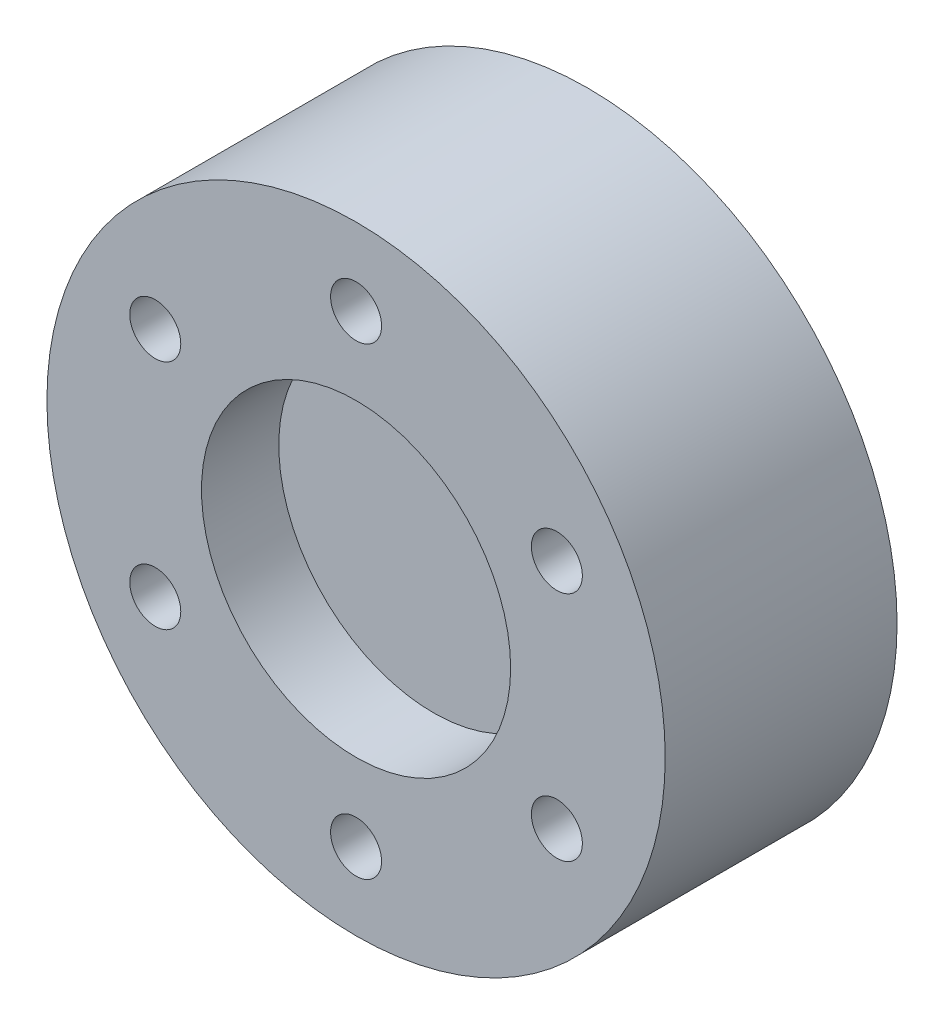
from build123d import *

# Parameters (mm, degrees)
SKETCH1_R           = 20
BOSS_EXTRUDE1_DEPTH = 15
SKETCH2_R           = 10
CUT_EXTRUDE1_DEPTH  = 5
CIRPATTERN1_COUNT   = 6
SKETCH5_R           = 17.5
CUT_EXTRUDE2_DEPTH  = 3


with BuildPart() as part:
    # Sketch1 → Boss-Extrude1 (new body)
    with BuildSketch(Plane.XY):
        Circle(SKETCH1_R)
    extrude(amount=BOSS_EXTRUDE1_DEPTH)

    # Sketch2 → Cut-Extrude1 (cut)
    with BuildSketch(Plane.XY.offset(15)):
        Circle(SKETCH2_R)
    extrude(amount=-CUT_EXTRUDE1_DEPTH, mode=Mode.SUBTRACT)

    # Sketch4 → M4x0.7 Tapped Hole1 (revolve, cut)
    with BuildSketch(Plane(origin=(0, 15, 15), x_dir=(0, -1, 0), z_dir=(1, 0, 0))):
        Polygon((0, 0), (0, 8.091420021), (1.65, 7.1), (1.65, 0), align=None)
    m4x0_7_tapped_hole1 = revolve(axis=Axis((0, 15, 21.35), (0, 0, -1)), mode=Mode.SUBTRACT)

    # CirPattern1: M4x0.7 Tapped Hole1 ×6 about axis
    cirpattern1_axis = Axis((0, 0, 0), (0, 0, 1))
    for i in range(1, CIRPATTERN1_COUNT):
        add(m4x0_7_tapped_hole1.rotate(cirpattern1_axis, i * 360 / CIRPATTERN1_COUNT), mode=Mode.SUBTRACT)

    # Sketch5 → Cut-Extrude2 (cut)
    with BuildSketch(Plane(origin=(0, 0, 0), x_dir=(-1, 0, 0), z_dir=(0, 0, -1))):
        Circle(SKETCH5_R)
    extrude(amount=-CUT_EXTRUDE2_DEPTH, mode=Mode.SUBTRACT)


solid = part.part
